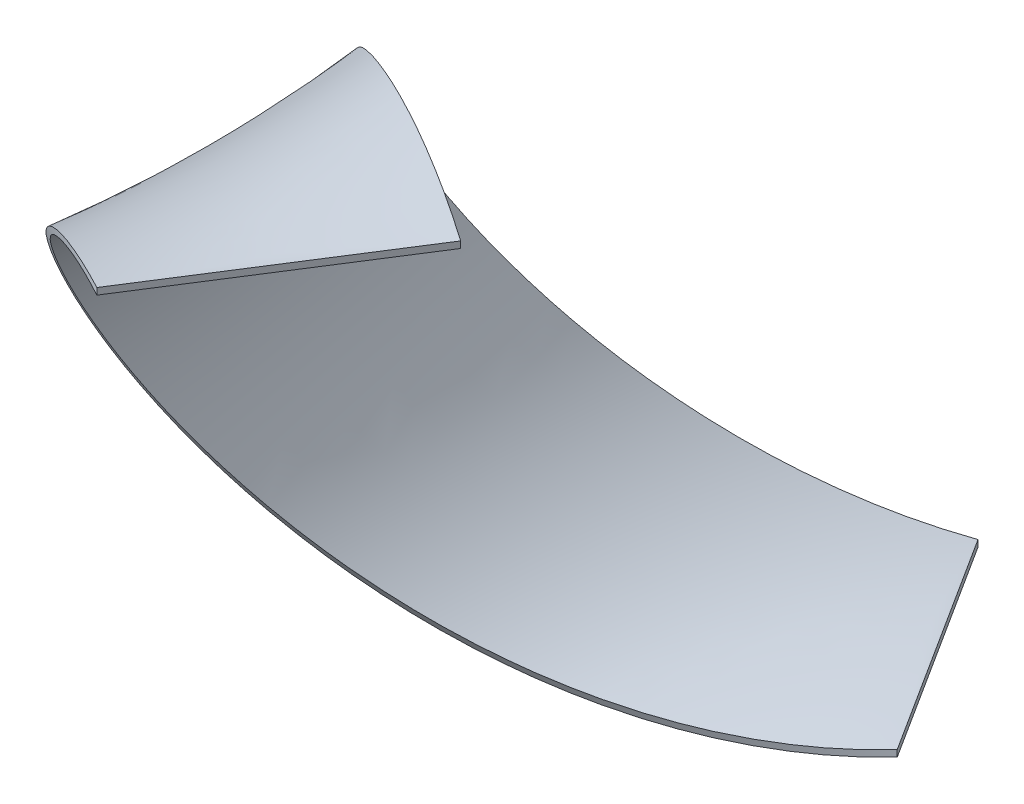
ISO-10303-21;
HEADER;
FILE_DESCRIPTION(('STEP AP214'),'2;1');
FILE_NAME('part.step','',(''),(''),'','','');
FILE_SCHEMA(('AUTOMOTIVE_DESIGN { 1 0 10303 214 1 1 1 1 }'));
ENDSEC;
DATA;
#1=APPLICATION_CONTEXT('core data for automotive mechanical design processes');
#2=APPLICATION_PROTOCOL_DEFINITION('international standard','automotive_design',2000,#1);
#3=PRODUCT_CONTEXT('',#1,'mechanical');
#4=PRODUCT('Part','Part','',(#3));
#5=PRODUCT_RELATED_PRODUCT_CATEGORY('part','',(#4));
#6=PRODUCT_DEFINITION_FORMATION('','',#4);
#7=PRODUCT_DEFINITION_CONTEXT('part definition',#1,'design');
#8=PRODUCT_DEFINITION('design','',#6,#7);
#9=PRODUCT_DEFINITION_SHAPE('','',#8);
#10=(LENGTH_UNIT() NAMED_UNIT(*) SI_UNIT(.MILLI.,.METRE.));
#11=(NAMED_UNIT(*) PLANE_ANGLE_UNIT() SI_UNIT($,.RADIAN.));
#12=(NAMED_UNIT(*) SI_UNIT($,.STERADIAN.) SOLID_ANGLE_UNIT());
#13=UNCERTAINTY_MEASURE_WITH_UNIT(LENGTH_MEASURE(1.E-05),#10,'distance_accuracy_value','');
#14=(GEOMETRIC_REPRESENTATION_CONTEXT(3) GLOBAL_UNCERTAINTY_ASSIGNED_CONTEXT((#13)) GLOBAL_UNIT_ASSIGNED_CONTEXT((#10,
#11,#12)) REPRESENTATION_CONTEXT('',''));
#15=CARTESIAN_POINT('',(0.,0.,0.));
#16=DIRECTION('',(0.,0.,1.));
#17=DIRECTION('',(1.,0.,0.));
#18=AXIS2_PLACEMENT_3D('',#15,#16,#17);
#19=CARTESIAN_POINT('',(5.37029272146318,-25.,8.43563608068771));
#20=DIRECTION('',(0.843563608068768,0.,-0.537029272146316));
#21=DIRECTION('',(-0.537029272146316,0.,-0.843563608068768));
#22=AXIS2_PLACEMENT_3D('',#19,#20,#21);
#23=PLANE('',#22);
#24=DIRECTION('',(0.,-1.,0.));
#25=VECTOR('',#24,1.);
#26=CARTESIAN_POINT('',(5.37029272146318,-24.75,8.43563608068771));
#27=LINE('',#26,#25);
#28=CARTESIAN_POINT('',(5.37029272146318,-24.75,8.43563608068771));
#29=VERTEX_POINT('',#28);
#30=CARTESIAN_POINT('',(5.37029272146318,-25.25,8.4356360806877));
#31=VERTEX_POINT('',#30);
#32=EDGE_CURVE('E49',#29,#31,#27,.T.);
#33=ORIENTED_EDGE('',*,*,#32,.T.);
#34=DIRECTION('',(-0.537029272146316,0.,-0.843563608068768));
#35=VECTOR('',#34,1.);
#36=CARTESIAN_POINT('',(-5.37029272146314,-25.25,-8.43563608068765));
#37=LINE('',#36,#35);
#38=CARTESIAN_POINT('',(-5.37029272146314,-25.25,-8.43563608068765));
#39=VERTEX_POINT('',#38);
#40=EDGE_CURVE('E57',#31,#39,#37,.T.);
#41=ORIENTED_EDGE('',*,*,#40,.T.);
#42=DIRECTION('',(0.,1.,0.));
#43=VECTOR('',#42,1.);
#44=CARTESIAN_POINT('',(-5.37029272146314,-24.75,-8.43563608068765));
#45=LINE('',#44,#43);
#46=CARTESIAN_POINT('',(-5.37029272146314,-24.75,-8.43563608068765));
#47=VERTEX_POINT('',#46);
#48=EDGE_CURVE('E88',#39,#47,#45,.T.);
#49=ORIENTED_EDGE('',*,*,#48,.T.);
#50=DIRECTION('',(0.537029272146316,0.,0.843563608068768));
#51=VECTOR('',#50,1.);
#52=CARTESIAN_POINT('',(-5.37029272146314,-24.75,-8.43563608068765));
#53=LINE('',#52,#51);
#54=EDGE_CURVE('E85',#47,#29,#53,.T.);
#55=ORIENTED_EDGE('',*,*,#54,.T.);
#56=EDGE_LOOP('',(#33,#41,#49,#55));
#57=FACE_BOUND('',#56,.T.);
#58=ADVANCED_FACE('F40',(#57),#23,.T.);
#59=CARTESIAN_POINT('',(-5.37029272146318,25.,58.4356360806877));
#60=DIRECTION('',(0.843563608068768,0.,0.537029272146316));
#61=DIRECTION('',(0.537029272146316,0.,-0.843563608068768));
#62=AXIS2_PLACEMENT_3D('',#59,#60,#61);
#63=PLANE('',#62);
#64=DIRECTION('',(0.,1.,0.));
#65=VECTOR('',#64,1.);
#66=CARTESIAN_POINT('',(-5.37029272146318,25.,58.4356360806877));
#67=LINE('',#66,#65);
#68=CARTESIAN_POINT('',(-5.37029272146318,24.75,58.4356360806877));
#69=VERTEX_POINT('',#68);
#70=CARTESIAN_POINT('',(-5.37029272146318,25.25,58.4356360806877));
#71=VERTEX_POINT('',#70);
#72=EDGE_CURVE('E12',#69,#71,#67,.T.);
#73=ORIENTED_EDGE('',*,*,#72,.F.);
#74=DIRECTION('',(-0.537029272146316,0.,0.843563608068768));
#75=VECTOR('',#74,1.);
#76=CARTESIAN_POINT('',(5.37029272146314,24.75,41.5643639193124));
#77=LINE('',#76,#75);
#78=CARTESIAN_POINT('',(5.37029272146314,24.75,41.5643639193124));
#79=VERTEX_POINT('',#78);
#80=EDGE_CURVE('E92',#79,#69,#77,.T.);
#81=ORIENTED_EDGE('',*,*,#80,.F.);
#82=DIRECTION('',(0.,-1.,0.));
#83=VECTOR('',#82,1.);
#84=CARTESIAN_POINT('',(5.37029272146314,25.,41.5643639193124));
#85=LINE('',#84,#83);
#86=CARTESIAN_POINT('',(5.37029272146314,25.25,41.5643639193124));
#87=VERTEX_POINT('',#86);
#88=EDGE_CURVE('E113',#87,#79,#85,.T.);
#89=ORIENTED_EDGE('',*,*,#88,.F.);
#90=DIRECTION('',(0.537029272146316,0.,-0.843563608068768));
#91=VECTOR('',#90,1.);
#92=CARTESIAN_POINT('',(0.,25.25,50.));
#93=LINE('',#92,#91);
#94=EDGE_CURVE('E65',#71,#87,#93,.T.);
#95=ORIENTED_EDGE('',*,*,#94,.F.);
#96=EDGE_LOOP('',(#73,#81,#89,#95));
#97=FACE_BOUND('',#96,.T.);
#98=ADVANCED_FACE('F42',(#97),#63,.T.);
#99=CARTESIAN_POINT('',(5.37029272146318,-24.75,8.43563608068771));
#100=CARTESIAN_POINT('',(3.07686747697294,-25.2476309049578,9.90622431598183));
#101=CARTESIAN_POINT('',(0.731052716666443,-25.3153729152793,11.3768125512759));
#102=CARTESIAN_POINT('',(-1.61476204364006,-25.3831149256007,12.8474007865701));
#103=CARTESIAN_POINT('',(-3.93308241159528,-25.0186611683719,14.3179890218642));
#104=CARTESIAN_POINT('',(-6.2514027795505,-24.6542074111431,15.7885772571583));
#105=CARTESIAN_POINT('',(-8.46328113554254,-23.8699689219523,17.2591654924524));
#106=CARTESIAN_POINT('',(-10.6751594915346,-23.0857304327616,18.7297537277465));
#107=CARTESIAN_POINT('',(-12.7052729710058,-21.9084135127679,20.2003419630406));
#108=CARTESIAN_POINT('',(-14.735386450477,-20.7310965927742,21.6709301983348));
#109=CARTESIAN_POINT('',(-16.5146019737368,-19.2007933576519,23.1415184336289));
#110=CARTESIAN_POINT('',(-18.2938174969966,-17.6704901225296,24.612106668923));
#111=CARTESIAN_POINT('',(-19.7615460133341,-15.8393132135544,26.0826949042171));
#112=CARTESIAN_POINT('',(-21.2292745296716,-14.0081363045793,27.5532831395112));
#113=CARTESIAN_POINT('',(-22.3355343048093,-11.9384442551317,29.0238713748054));
#114=CARTESIAN_POINT('',(-23.441794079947,-9.86875220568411,30.4944596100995));
#115=CARTESIAN_POINT('',(-24.148912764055,-7.63102589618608,31.9650478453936));
#116=CARTESIAN_POINT('',(-24.8560314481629,-5.39329958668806,33.4356360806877));
#117=CARTESIAN_POINT('',(-25.1399289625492,-3.06374210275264,34.9062243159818));
#118=CARTESIAN_POINT('',(-25.4238264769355,-0.734184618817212,36.3768125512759));
#119=CARTESIAN_POINT('',(-25.2748350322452,1.60787375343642,37.8474007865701));
#120=CARTESIAN_POINT('',(-25.125843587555,3.94993212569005,39.3179890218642));
#121=CARTESIAN_POINT('',(-24.5490369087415,6.22473539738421,40.7885772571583));
#122=CARTESIAN_POINT('',(-23.9722302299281,8.49953866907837,42.2591654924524));
#123=CARTESIAN_POINT('',(-22.9872507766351,10.6296211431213,43.7297537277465));
#124=CARTESIAN_POINT('',(-22.0022713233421,12.7597036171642,45.2003419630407));
#125=CARTESIAN_POINT('',(-20.6426613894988,14.6725278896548,46.6709301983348));
#126=CARTESIAN_POINT('',(-19.2830514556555,16.5853521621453,48.1415184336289));
#127=CARTESIAN_POINT('',(-17.5951109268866,18.2157792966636,49.612106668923));
#128=CARTESIAN_POINT('',(-15.9071703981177,19.8462064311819,51.0826949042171));
#129=CARTESIAN_POINT('',(-13.9483800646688,21.1387141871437,52.5532831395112));
#130=CARTESIAN_POINT('',(-11.9895897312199,22.4312219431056,54.0238713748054));
#131=CARTESIAN_POINT('',(-9.82665384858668,23.3417955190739,55.4944596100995));
#132=CARTESIAN_POINT('',(-7.66371796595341,24.2523690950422,56.9650478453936));
#133=CARTESIAN_POINT('',(-5.37029272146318,24.75,58.4356360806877));
#134=CARTESIAN_POINT('',(5.37029272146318,-25.25,8.4356360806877));
#135=CARTESIAN_POINT('',(3.03053565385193,-25.7476309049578,9.90622431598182));
#136=CARTESIAN_POINT('',(0.639177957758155,-25.8068594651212,11.3768125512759));
#137=CARTESIAN_POINT('',(-1.75217973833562,-25.8660880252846,12.8474007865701));
#138=CARTESIAN_POINT('',(-4.11370324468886,-25.4848972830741,14.3179890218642));
#139=CARTESIAN_POINT('',(-6.4752267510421,-25.1037065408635,15.7885772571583));
#140=CARTESIAN_POINT('',(-8.72649721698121,-24.2950774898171,17.2591654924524));
#141=CARTESIAN_POINT('',(-10.9777676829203,-23.4864484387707,18.7297537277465));
#142=CARTESIAN_POINT('',(-13.0421207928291,-22.2779179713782,20.2003419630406));
#143=CARTESIAN_POINT('',(-15.1064739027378,-21.0693875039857,21.6709301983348));
#144=CARTESIAN_POINT('',(-16.9136105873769,-19.5021106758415,23.1415184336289));
#145=CARTESIAN_POINT('',(-18.720747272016,-17.9348338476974,24.612106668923));
#146=CARTESIAN_POINT('',(-20.2091276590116,-16.0621823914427,26.0826949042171));
#147=CARTESIAN_POINT('',(-21.6975080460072,-14.189530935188,27.5532831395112));
#148=CARTESIAN_POINT('',(-22.8164471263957,-12.0752757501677,29.0238713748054));
#149=CARTESIAN_POINT('',(-23.9353862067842,-9.96102056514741,30.4944596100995));
#150=CARTESIAN_POINT('',(-24.6467798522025,-7.67716007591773,31.9650478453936));
#151=CARTESIAN_POINT('',(-25.3581734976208,-5.39329958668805,33.4356360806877));
#152=CARTESIAN_POINT('',(-25.6377960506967,-3.01760792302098,34.9062243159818));
#153=CARTESIAN_POINT('',(-25.9174186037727,-0.641916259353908,36.3768125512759));
#154=CARTESIAN_POINT('',(-25.7557478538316,1.74470524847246,37.8474007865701));
#155=CARTESIAN_POINT('',(-25.5940771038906,4.13132675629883,39.3179890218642));
#156=CARTESIAN_POINT('',(-24.996618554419,6.44760457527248,40.7885772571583));
#157=CARTESIAN_POINT('',(-24.3991600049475,8.76388239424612,42.2591654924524));
#158=CARTESIAN_POINT('',(-23.3862593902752,10.9309384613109,43.7297537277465));
#159=CARTESIAN_POINT('',(-22.3733587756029,13.0979945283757,45.2003419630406));
#160=CARTESIAN_POINT('',(-20.9795092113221,15.0420323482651,46.6709301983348));
#161=CARTESIAN_POINT('',(-19.5856596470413,16.9860701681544,48.1415184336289));
#162=CARTESIAN_POINT('',(-17.8583270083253,18.6408878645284,49.612106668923));
#163=CARTESIAN_POINT('',(-16.1309943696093,20.2957055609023,51.0826949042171));
#164=CARTESIAN_POINT('',(-14.1290008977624,21.6049503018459,52.5532831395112));
#165=CARTESIAN_POINT('',(-12.1270074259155,22.9141950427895,54.0238713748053));
#166=CARTESIAN_POINT('',(-9.91852860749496,23.8332820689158,55.4944596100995));
#167=CARTESIAN_POINT('',(-7.71004978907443,24.7523690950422,56.9650478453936));
#168=CARTESIAN_POINT('',(-5.37029272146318,25.25,58.4356360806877));
#169=(BOUNDED_SURFACE() B_SPLINE_SURFACE(1,2,((#99,#100,#101,#102,#103,#104,#105,#106,#107,#108,
#109,#110,#111,#112,#113,#114,#115,#116,#117,#118,#119,#120,#121,#122,#123,#124,#125,#126,#127,
#128,#129,#130,#131,#132,#133),(#134,#135,#136,#137,#138,#139,#140,#141,#142,#143,#144,#145,
#146,#147,#148,#149,#150,#151,#152,#153,#154,#155,#156,#157,#158,#159,#160,#161,#162,#163,#164,
#165,#166,#167,#168)),.UNSPECIFIED.,.F.,.F.,.F.) B_SPLINE_SURFACE_WITH_KNOTS((2,2),(3,2,2,2,2,2,
2,2,2,2,2,2,2,2,2,2,2,3),(0.,0.0121951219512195),(0.,0.0294117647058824,0.0588235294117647,
0.0882352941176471,0.117647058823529,0.147058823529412,0.176470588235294,0.205882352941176,
0.235294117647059,0.264705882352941,0.294117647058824,0.323529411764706,0.352941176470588,
0.382352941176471,0.411764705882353,0.441176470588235,0.470588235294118,0.5),
.UNSPECIFIED.) GEOMETRIC_REPRESENTATION_ITEM() RATIONAL_B_SPLINE_SURFACE(((1.,0.995734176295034,
1.,0.995734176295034,1.,0.995734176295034,1.,0.995734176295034,1.,0.995734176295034,1.,
0.995734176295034,1.,0.995734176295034,1.,0.995734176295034,1.,0.995734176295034,1.,
0.995734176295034,1.,0.995734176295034,1.,0.995734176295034,1.,0.995734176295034,1.,
0.995734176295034,1.,0.995734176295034,1.,0.995734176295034,1.,0.995734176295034,1.),(1.,
0.995734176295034,1.,0.995734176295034,1.,0.995734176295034,1.,0.995734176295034,1.,
0.995734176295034,1.,0.995734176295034,1.,0.995734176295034,1.,0.995734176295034,1.,
0.995734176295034,1.,0.995734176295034,1.,0.995734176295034,1.,0.995734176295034,1.,
0.995734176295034,1.,0.995734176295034,1.,0.995734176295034,1.,0.995734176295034,1.,
0.995734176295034,1.))) REPRESENTATION_ITEM('') SURFACE());
#170=CARTESIAN_POINT('',(5.37029272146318,-24.75,8.43563608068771));
#171=CARTESIAN_POINT('',(3.07686747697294,-25.2476309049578,9.90622431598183));
#172=CARTESIAN_POINT('',(0.731052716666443,-25.3153729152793,11.3768125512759));
#173=CARTESIAN_POINT('',(-1.61476204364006,-25.3831149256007,12.8474007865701));
#174=CARTESIAN_POINT('',(-3.93308241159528,-25.0186611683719,14.3179890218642));
#175=CARTESIAN_POINT('',(-6.2514027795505,-24.6542074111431,15.7885772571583));
#176=CARTESIAN_POINT('',(-8.46328113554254,-23.8699689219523,17.2591654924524));
#177=CARTESIAN_POINT('',(-10.6751594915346,-23.0857304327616,18.7297537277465));
#178=CARTESIAN_POINT('',(-12.7052729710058,-21.9084135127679,20.2003419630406));
#179=CARTESIAN_POINT('',(-14.735386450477,-20.7310965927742,21.6709301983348));
#180=CARTESIAN_POINT('',(-16.5146019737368,-19.2007933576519,23.1415184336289));
#181=CARTESIAN_POINT('',(-18.2938174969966,-17.6704901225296,24.612106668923));
#182=CARTESIAN_POINT('',(-19.7615460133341,-15.8393132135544,26.0826949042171));
#183=CARTESIAN_POINT('',(-21.2292745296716,-14.0081363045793,27.5532831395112));
#184=CARTESIAN_POINT('',(-22.3355343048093,-11.9384442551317,29.0238713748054));
#185=CARTESIAN_POINT('',(-23.441794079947,-9.86875220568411,30.4944596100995));
#186=CARTESIAN_POINT('',(-24.148912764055,-7.63102589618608,31.9650478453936));
#187=CARTESIAN_POINT('',(-24.8560314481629,-5.39329958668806,33.4356360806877));
#188=CARTESIAN_POINT('',(-25.1399289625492,-3.06374210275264,34.9062243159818));
#189=CARTESIAN_POINT('',(-25.4238264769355,-0.734184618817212,36.3768125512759));
#190=CARTESIAN_POINT('',(-25.2748350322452,1.60787375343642,37.8474007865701));
#191=CARTESIAN_POINT('',(-25.125843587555,3.94993212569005,39.3179890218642));
#192=CARTESIAN_POINT('',(-24.5490369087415,6.22473539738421,40.7885772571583));
#193=CARTESIAN_POINT('',(-23.9722302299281,8.49953866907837,42.2591654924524));
#194=CARTESIAN_POINT('',(-22.9872507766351,10.6296211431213,43.7297537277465));
#195=CARTESIAN_POINT('',(-22.0022713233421,12.7597036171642,45.2003419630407));
#196=CARTESIAN_POINT('',(-20.6426613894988,14.6725278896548,46.6709301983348));
#197=CARTESIAN_POINT('',(-19.2830514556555,16.5853521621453,48.1415184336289));
#198=CARTESIAN_POINT('',(-17.5951109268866,18.2157792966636,49.612106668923));
#199=CARTESIAN_POINT('',(-15.9071703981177,19.8462064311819,51.0826949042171));
#200=CARTESIAN_POINT('',(-13.9483800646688,21.1387141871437,52.5532831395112));
#201=CARTESIAN_POINT('',(-11.9895897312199,22.4312219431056,54.0238713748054));
#202=CARTESIAN_POINT('',(-9.82665384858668,23.3417955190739,55.4944596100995));
#203=CARTESIAN_POINT('',(-7.66371796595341,24.2523690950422,56.9650478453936));
#204=CARTESIAN_POINT('',(-5.37029272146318,24.75,58.4356360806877));
#205=(BOUNDED_CURVE() B_SPLINE_CURVE(2,(#170,#171,#172,#173,#174,#175,#176,#177,#178,#179,#180,
#181,#182,#183,#184,#185,#186,#187,#188,#189,#190,#191,#192,#193,#194,#195,#196,#197,#198,#199,
#200,#201,#202,#203,#204),.UNSPECIFIED.,.F.,.F.) B_SPLINE_CURVE_WITH_KNOTS((3,2,2,2,2,2,2,2,2,2,
2,2,2,2,2,2,2,3),(0.,0.0294117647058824,0.0588235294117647,0.0882352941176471,0.117647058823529,
0.147058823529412,0.176470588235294,0.205882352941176,0.235294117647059,0.264705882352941,
0.294117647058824,0.323529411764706,0.352941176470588,0.382352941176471,0.411764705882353,
0.441176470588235,0.470588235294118,0.5),
.UNSPECIFIED.) CURVE() GEOMETRIC_REPRESENTATION_ITEM() RATIONAL_B_SPLINE_CURVE((1.,
0.995734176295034,1.,0.995734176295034,1.,0.995734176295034,1.,0.995734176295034,1.,
0.995734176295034,1.,0.995734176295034,1.,0.995734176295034,1.,0.995734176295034,1.,
0.995734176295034,1.,0.995734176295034,1.,0.995734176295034,1.,0.995734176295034,1.,
0.995734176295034,1.,0.995734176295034,1.,0.995734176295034,1.,0.995734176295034,1.,
0.995734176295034,1.)) REPRESENTATION_ITEM(''));
#206=EDGE_CURVE('E94',#29,#69,#205,.T.);
#207=CARTESIAN_POINT('',(5.37029272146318,-25.25,8.4356360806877));
#208=CARTESIAN_POINT('',(3.03053565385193,-25.7476309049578,9.90622431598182));
#209=CARTESIAN_POINT('',(0.639177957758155,-25.8068594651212,11.3768125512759));
#210=CARTESIAN_POINT('',(-1.75217973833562,-25.8660880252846,12.8474007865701));
#211=CARTESIAN_POINT('',(-4.11370324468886,-25.4848972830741,14.3179890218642));
#212=CARTESIAN_POINT('',(-6.4752267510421,-25.1037065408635,15.7885772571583));
#213=CARTESIAN_POINT('',(-8.72649721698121,-24.2950774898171,17.2591654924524));
#214=CARTESIAN_POINT('',(-10.9777676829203,-23.4864484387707,18.7297537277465));
#215=CARTESIAN_POINT('',(-13.0421207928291,-22.2779179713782,20.2003419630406));
#216=CARTESIAN_POINT('',(-15.1064739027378,-21.0693875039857,21.6709301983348));
#217=CARTESIAN_POINT('',(-16.9136105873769,-19.5021106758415,23.1415184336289));
#218=CARTESIAN_POINT('',(-18.720747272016,-17.9348338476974,24.612106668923));
#219=CARTESIAN_POINT('',(-20.2091276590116,-16.0621823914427,26.0826949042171));
#220=CARTESIAN_POINT('',(-21.6975080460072,-14.189530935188,27.5532831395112));
#221=CARTESIAN_POINT('',(-22.8164471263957,-12.0752757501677,29.0238713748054));
#222=CARTESIAN_POINT('',(-23.9353862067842,-9.96102056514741,30.4944596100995));
#223=CARTESIAN_POINT('',(-24.6467798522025,-7.67716007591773,31.9650478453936));
#224=CARTESIAN_POINT('',(-25.3581734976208,-5.39329958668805,33.4356360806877));
#225=CARTESIAN_POINT('',(-25.6377960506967,-3.01760792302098,34.9062243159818));
#226=CARTESIAN_POINT('',(-25.9174186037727,-0.641916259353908,36.3768125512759));
#227=CARTESIAN_POINT('',(-25.7557478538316,1.74470524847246,37.8474007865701));
#228=CARTESIAN_POINT('',(-25.5940771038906,4.13132675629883,39.3179890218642));
#229=CARTESIAN_POINT('',(-24.996618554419,6.44760457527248,40.7885772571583));
#230=CARTESIAN_POINT('',(-24.3991600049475,8.76388239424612,42.2591654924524));
#231=CARTESIAN_POINT('',(-23.3862593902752,10.9309384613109,43.7297537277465));
#232=CARTESIAN_POINT('',(-22.3733587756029,13.0979945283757,45.2003419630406));
#233=CARTESIAN_POINT('',(-20.9795092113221,15.0420323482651,46.6709301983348));
#234=CARTESIAN_POINT('',(-19.5856596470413,16.9860701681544,48.1415184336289));
#235=CARTESIAN_POINT('',(-17.8583270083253,18.6408878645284,49.612106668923));
#236=CARTESIAN_POINT('',(-16.1309943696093,20.2957055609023,51.0826949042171));
#237=CARTESIAN_POINT('',(-14.1290008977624,21.6049503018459,52.5532831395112));
#238=CARTESIAN_POINT('',(-12.1270074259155,22.9141950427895,54.0238713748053));
#239=CARTESIAN_POINT('',(-9.91852860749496,23.8332820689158,55.4944596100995));
#240=CARTESIAN_POINT('',(-7.71004978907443,24.7523690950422,56.9650478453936));
#241=CARTESIAN_POINT('',(-5.37029272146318,25.25,58.4356360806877));
#242=(BOUNDED_CURVE() B_SPLINE_CURVE(2,(#207,#208,#209,#210,#211,#212,#213,#214,#215,#216,#217,
#218,#219,#220,#221,#222,#223,#224,#225,#226,#227,#228,#229,#230,#231,#232,#233,#234,#235,#236,
#237,#238,#239,#240,#241),.UNSPECIFIED.,.F.,.F.) B_SPLINE_CURVE_WITH_KNOTS((3,2,2,2,2,2,2,2,2,2,
2,2,2,2,2,2,2,3),(0.,0.0294117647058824,0.0588235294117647,0.0882352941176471,0.117647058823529,
0.147058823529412,0.176470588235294,0.205882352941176,0.235294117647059,0.264705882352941,
0.294117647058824,0.323529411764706,0.352941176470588,0.382352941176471,0.411764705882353,
0.441176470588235,0.470588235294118,0.5),
.UNSPECIFIED.) CURVE() GEOMETRIC_REPRESENTATION_ITEM() RATIONAL_B_SPLINE_CURVE((1.,
0.995734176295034,1.,0.995734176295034,1.,0.995734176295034,1.,0.995734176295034,1.,
0.995734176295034,1.,0.995734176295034,1.,0.995734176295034,1.,0.995734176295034,1.,
0.995734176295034,1.,0.995734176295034,1.,0.995734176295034,1.,0.995734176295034,1.,
0.995734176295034,1.,0.995734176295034,1.,0.995734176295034,1.,0.995734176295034,1.,
0.995734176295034,1.)) REPRESENTATION_ITEM(''));
#243=EDGE_CURVE('E100',#31,#71,#242,.T.);
#244=ORIENTED_EDGE('',*,*,#32,.F.);
#245=ORIENTED_EDGE('',*,*,#206,.T.);
#246=ORIENTED_EDGE('',*,*,#72,.T.);
#247=ORIENTED_EDGE('',*,*,#243,.F.);
#248=EDGE_LOOP('',(#244,#245,#246,#247));
#249=FACE_BOUND('',#248,.T.);
#250=ADVANCED_FACE('F99',(#249),#169,.F.);
#251=CARTESIAN_POINT('',(5.37029272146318,-25.25,8.4356360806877));
#252=CARTESIAN_POINT('',(3.03053565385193,-25.7476309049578,9.90622431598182));
#253=CARTESIAN_POINT('',(0.639177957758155,-25.8068594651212,11.3768125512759));
#254=CARTESIAN_POINT('',(-1.75217973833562,-25.8660880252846,12.8474007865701));
#255=CARTESIAN_POINT('',(-4.11370324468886,-25.4848972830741,14.3179890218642));
#256=CARTESIAN_POINT('',(-6.4752267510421,-25.1037065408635,15.7885772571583));
#257=CARTESIAN_POINT('',(-8.72649721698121,-24.2950774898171,17.2591654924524));
#258=CARTESIAN_POINT('',(-10.9777676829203,-23.4864484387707,18.7297537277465));
#259=CARTESIAN_POINT('',(-13.0421207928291,-22.2779179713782,20.2003419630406));
#260=CARTESIAN_POINT('',(-15.1064739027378,-21.0693875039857,21.6709301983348));
#261=CARTESIAN_POINT('',(-16.9136105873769,-19.5021106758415,23.1415184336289));
#262=CARTESIAN_POINT('',(-18.720747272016,-17.9348338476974,24.612106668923));
#263=CARTESIAN_POINT('',(-20.2091276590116,-16.0621823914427,26.0826949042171));
#264=CARTESIAN_POINT('',(-21.6975080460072,-14.189530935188,27.5532831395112));
#265=CARTESIAN_POINT('',(-22.8164471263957,-12.0752757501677,29.0238713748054));
#266=CARTESIAN_POINT('',(-23.9353862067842,-9.96102056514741,30.4944596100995));
#267=CARTESIAN_POINT('',(-24.6467798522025,-7.67716007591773,31.9650478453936));
#268=CARTESIAN_POINT('',(-25.3581734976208,-5.39329958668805,33.4356360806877));
#269=CARTESIAN_POINT('',(-25.6377960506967,-3.01760792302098,34.9062243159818));
#270=CARTESIAN_POINT('',(-25.9174186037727,-0.641916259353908,36.3768125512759));
#271=CARTESIAN_POINT('',(-25.7557478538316,1.74470524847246,37.8474007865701));
#272=CARTESIAN_POINT('',(-25.5940771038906,4.13132675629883,39.3179890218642));
#273=CARTESIAN_POINT('',(-24.996618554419,6.44760457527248,40.7885772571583));
#274=CARTESIAN_POINT('',(-24.3991600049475,8.76388239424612,42.2591654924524));
#275=CARTESIAN_POINT('',(-23.3862593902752,10.9309384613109,43.7297537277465));
#276=CARTESIAN_POINT('',(-22.3733587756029,13.0979945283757,45.2003419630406));
#277=CARTESIAN_POINT('',(-20.9795092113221,15.0420323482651,46.6709301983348));
#278=CARTESIAN_POINT('',(-19.5856596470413,16.9860701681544,48.1415184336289));
#279=CARTESIAN_POINT('',(-17.8583270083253,18.6408878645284,49.612106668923));
#280=CARTESIAN_POINT('',(-16.1309943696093,20.2957055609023,51.0826949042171));
#281=CARTESIAN_POINT('',(-14.1290008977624,21.6049503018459,52.5532831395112));
#282=CARTESIAN_POINT('',(-12.1270074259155,22.9141950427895,54.0238713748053));
#283=CARTESIAN_POINT('',(-9.91852860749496,23.8332820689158,55.4944596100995));
#284=CARTESIAN_POINT('',(-7.71004978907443,24.7523690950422,56.9650478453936));
#285=CARTESIAN_POINT('',(-5.37029272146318,25.25,58.4356360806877));
#286=CARTESIAN_POINT('',(-5.37029272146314,-25.25,-8.43563608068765));
#287=CARTESIAN_POINT('',(-7.71004978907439,-24.7523690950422,-6.96504784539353));
#288=CARTESIAN_POINT('',(-9.91852860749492,-23.8332820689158,-5.49445961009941));
#289=CARTESIAN_POINT('',(-12.1270074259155,-22.9141950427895,-4.0238713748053));
#290=CARTESIAN_POINT('',(-14.1290008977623,-21.6049503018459,-2.55328313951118));
#291=CARTESIAN_POINT('',(-16.1309943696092,-20.2957055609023,-1.08269490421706));
#292=CARTESIAN_POINT('',(-17.8583270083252,-18.6408878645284,0.387893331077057));
#293=CARTESIAN_POINT('',(-19.5856596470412,-16.9860701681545,1.85848156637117));
#294=CARTESIAN_POINT('',(-20.979509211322,-15.0420323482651,3.32906980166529));
#295=CARTESIAN_POINT('',(-22.3733587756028,-13.0979945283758,4.79965803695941));
#296=CARTESIAN_POINT('',(-23.3862593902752,-10.930938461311,6.27024627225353));
#297=CARTESIAN_POINT('',(-24.3991600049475,-8.76388239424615,7.74083450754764));
#298=CARTESIAN_POINT('',(-24.996618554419,-6.44760457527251,9.21142274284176));
#299=CARTESIAN_POINT('',(-25.5940771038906,-4.13132675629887,10.6820109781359));
#300=CARTESIAN_POINT('',(-25.7557478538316,-1.74470524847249,12.15259921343));
#301=CARTESIAN_POINT('',(-25.9174186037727,0.641916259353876,13.6231874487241));
#302=CARTESIAN_POINT('',(-25.6377960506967,3.01760792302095,15.0937756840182));
#303=CARTESIAN_POINT('',(-25.3581734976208,5.39329958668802,16.5643639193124));
#304=CARTESIAN_POINT('',(-24.6467798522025,7.6771600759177,18.0349521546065));
#305=CARTESIAN_POINT('',(-23.9353862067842,9.96102056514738,19.5055403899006));
#306=CARTESIAN_POINT('',(-22.8164471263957,12.0752757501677,20.9761286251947));
#307=CARTESIAN_POINT('',(-21.6975080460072,14.189530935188,22.4467168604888));
#308=CARTESIAN_POINT('',(-20.2091276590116,16.0621823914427,23.9173050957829));
#309=CARTESIAN_POINT('',(-18.720747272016,17.9348338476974,25.3878933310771));
#310=CARTESIAN_POINT('',(-16.9136105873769,19.5021106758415,26.8584815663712));
#311=CARTESIAN_POINT('',(-15.1064739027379,21.0693875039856,28.3290698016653));
#312=CARTESIAN_POINT('',(-13.0421207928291,22.2779179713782,29.7996580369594));
#313=CARTESIAN_POINT('',(-10.9777676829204,23.4864484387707,31.2702462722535));
#314=CARTESIAN_POINT('',(-8.72649721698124,24.2950774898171,32.7408345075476));
#315=CARTESIAN_POINT('',(-6.47522675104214,25.1037065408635,34.2114227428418));
#316=CARTESIAN_POINT('',(-4.11370324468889,25.4848972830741,35.6820109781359));
#317=CARTESIAN_POINT('',(-1.75217973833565,25.8660880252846,37.15259921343));
#318=CARTESIAN_POINT('',(0.63917795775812,25.8068594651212,38.6231874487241));
#319=CARTESIAN_POINT('',(3.03053565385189,25.7476309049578,40.0937756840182));
#320=CARTESIAN_POINT('',(5.37029272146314,25.25,41.5643639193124));
#321=(BOUNDED_SURFACE() B_SPLINE_SURFACE(1,2,((#251,#252,#253,#254,#255,#256,#257,#258,#259,
#260,#261,#262,#263,#264,#265,#266,#267,#268,#269,#270,#271,#272,#273,#274,#275,#276,#277,#278,
#279,#280,#281,#282,#283,#284,#285),(#286,#287,#288,#289,#290,#291,#292,#293,#294,#295,#296,
#297,#298,#299,#300,#301,#302,#303,#304,#305,#306,#307,#308,#309,#310,#311,#312,#313,#314,#315,
#316,#317,#318,#319,#320)),.UNSPECIFIED.,.F.,.F.,.F.) B_SPLINE_SURFACE_WITH_KNOTS((2,2),(3,2,2,
2,2,2,2,2,2,2,2,2,2,2,2,2,2,3),(0.0121951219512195,0.5),(0.,0.0294117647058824,
0.0588235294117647,0.0882352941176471,0.117647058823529,0.147058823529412,0.176470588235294,
0.205882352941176,0.235294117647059,0.264705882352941,0.294117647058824,0.323529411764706,
0.352941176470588,0.382352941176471,0.411764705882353,0.441176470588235,0.470588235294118,0.5),
.UNSPECIFIED.) GEOMETRIC_REPRESENTATION_ITEM() RATIONAL_B_SPLINE_SURFACE(((1.,0.995734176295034,
1.,0.995734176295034,1.,0.995734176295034,1.,0.995734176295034,1.,0.995734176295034,1.,
0.995734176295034,1.,0.995734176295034,1.,0.995734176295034,1.,0.995734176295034,1.,
0.995734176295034,1.,0.995734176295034,1.,0.995734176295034,1.,0.995734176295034,1.,
0.995734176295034,1.,0.995734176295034,1.,0.995734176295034,1.,0.995734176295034,1.),(1.,
0.995734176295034,1.,0.995734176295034,1.,0.995734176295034,1.,0.995734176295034,1.,
0.995734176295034,1.,0.995734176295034,1.,0.995734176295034,1.,0.995734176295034,1.,
0.995734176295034,1.,0.995734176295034,1.,0.995734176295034,1.,0.995734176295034,1.,
0.995734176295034,1.,0.995734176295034,1.,0.995734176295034,1.,0.995734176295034,1.,
0.995734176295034,1.))) REPRESENTATION_ITEM('') SURFACE());
#322=CARTESIAN_POINT('',(-5.37029272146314,-25.25,-8.43563608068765));
#323=CARTESIAN_POINT('',(-7.71004978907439,-24.7523690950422,-6.96504784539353));
#324=CARTESIAN_POINT('',(-9.91852860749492,-23.8332820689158,-5.49445961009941));
#325=CARTESIAN_POINT('',(-12.1270074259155,-22.9141950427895,-4.0238713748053));
#326=CARTESIAN_POINT('',(-14.1290008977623,-21.6049503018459,-2.55328313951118));
#327=CARTESIAN_POINT('',(-16.1309943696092,-20.2957055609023,-1.08269490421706));
#328=CARTESIAN_POINT('',(-17.8583270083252,-18.6408878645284,0.387893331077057));
#329=CARTESIAN_POINT('',(-19.5856596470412,-16.9860701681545,1.85848156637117));
#330=CARTESIAN_POINT('',(-20.979509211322,-15.0420323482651,3.32906980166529));
#331=CARTESIAN_POINT('',(-22.3733587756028,-13.0979945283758,4.79965803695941));
#332=CARTESIAN_POINT('',(-23.3862593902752,-10.930938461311,6.27024627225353));
#333=CARTESIAN_POINT('',(-24.3991600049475,-8.76388239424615,7.74083450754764));
#334=CARTESIAN_POINT('',(-24.996618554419,-6.44760457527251,9.21142274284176));
#335=CARTESIAN_POINT('',(-25.5940771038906,-4.13132675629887,10.6820109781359));
#336=CARTESIAN_POINT('',(-25.7557478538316,-1.74470524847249,12.15259921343));
#337=CARTESIAN_POINT('',(-25.9174186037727,0.641916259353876,13.6231874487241));
#338=CARTESIAN_POINT('',(-25.6377960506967,3.01760792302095,15.0937756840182));
#339=CARTESIAN_POINT('',(-25.3581734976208,5.39329958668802,16.5643639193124));
#340=CARTESIAN_POINT('',(-24.6467798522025,7.6771600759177,18.0349521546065));
#341=CARTESIAN_POINT('',(-23.9353862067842,9.96102056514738,19.5055403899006));
#342=CARTESIAN_POINT('',(-22.8164471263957,12.0752757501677,20.9761286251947));
#343=CARTESIAN_POINT('',(-21.6975080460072,14.189530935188,22.4467168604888));
#344=CARTESIAN_POINT('',(-20.2091276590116,16.0621823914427,23.9173050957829));
#345=CARTESIAN_POINT('',(-18.720747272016,17.9348338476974,25.3878933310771));
#346=CARTESIAN_POINT('',(-16.9136105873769,19.5021106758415,26.8584815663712));
#347=CARTESIAN_POINT('',(-15.1064739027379,21.0693875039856,28.3290698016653));
#348=CARTESIAN_POINT('',(-13.0421207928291,22.2779179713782,29.7996580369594));
#349=CARTESIAN_POINT('',(-10.9777676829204,23.4864484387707,31.2702462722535));
#350=CARTESIAN_POINT('',(-8.72649721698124,24.2950774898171,32.7408345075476));
#351=CARTESIAN_POINT('',(-6.47522675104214,25.1037065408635,34.2114227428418));
#352=CARTESIAN_POINT('',(-4.11370324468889,25.4848972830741,35.6820109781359));
#353=CARTESIAN_POINT('',(-1.75217973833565,25.8660880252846,37.15259921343));
#354=CARTESIAN_POINT('',(0.63917795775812,25.8068594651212,38.6231874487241));
#355=CARTESIAN_POINT('',(3.03053565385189,25.7476309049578,40.0937756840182));
#356=CARTESIAN_POINT('',(5.37029272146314,25.25,41.5643639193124));
#357=(BOUNDED_CURVE() B_SPLINE_CURVE(2,(#322,#323,#324,#325,#326,#327,#328,#329,#330,#331,#332,
#333,#334,#335,#336,#337,#338,#339,#340,#341,#342,#343,#344,#345,#346,#347,#348,#349,#350,#351,
#352,#353,#354,#355,#356),.UNSPECIFIED.,.F.,.F.) B_SPLINE_CURVE_WITH_KNOTS((3,2,2,2,2,2,2,2,2,2,
2,2,2,2,2,2,2,3),(0.,0.0294117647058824,0.0588235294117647,0.0882352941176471,0.117647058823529,
0.147058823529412,0.176470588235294,0.205882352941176,0.235294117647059,0.264705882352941,
0.294117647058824,0.323529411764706,0.352941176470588,0.382352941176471,0.411764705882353,
0.441176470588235,0.470588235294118,0.5),
.UNSPECIFIED.) CURVE() GEOMETRIC_REPRESENTATION_ITEM() RATIONAL_B_SPLINE_CURVE((1.,
0.995734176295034,1.,0.995734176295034,1.,0.995734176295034,1.,0.995734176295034,1.,
0.995734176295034,1.,0.995734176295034,1.,0.995734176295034,1.,0.995734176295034,1.,
0.995734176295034,1.,0.995734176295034,1.,0.995734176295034,1.,0.995734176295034,1.,
0.995734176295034,1.,0.995734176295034,1.,0.995734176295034,1.,0.995734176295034,1.,
0.995734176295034,1.)) REPRESENTATION_ITEM(''));
#358=EDGE_CURVE('E109',#39,#87,#357,.T.);
#359=ORIENTED_EDGE('',*,*,#40,.F.);
#360=ORIENTED_EDGE('',*,*,#243,.T.);
#361=ORIENTED_EDGE('',*,*,#94,.T.);
#362=ORIENTED_EDGE('',*,*,#358,.F.);
#363=EDGE_LOOP('',(#359,#360,#361,#362));
#364=FACE_BOUND('',#363,.T.);
#365=ADVANCED_FACE('F154',(#364),#321,.F.);
#366=CARTESIAN_POINT('',(-5.37029272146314,-25.25,-8.43563608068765));
#367=CARTESIAN_POINT('',(-7.71004978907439,-24.7523690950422,-6.96504784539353));
#368=CARTESIAN_POINT('',(-9.91852860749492,-23.8332820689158,-5.49445961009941));
#369=CARTESIAN_POINT('',(-12.1270074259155,-22.9141950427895,-4.0238713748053));
#370=CARTESIAN_POINT('',(-14.1290008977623,-21.6049503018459,-2.55328313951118));
#371=CARTESIAN_POINT('',(-16.1309943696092,-20.2957055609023,-1.08269490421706));
#372=CARTESIAN_POINT('',(-17.8583270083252,-18.6408878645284,0.387893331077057));
#373=CARTESIAN_POINT('',(-19.5856596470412,-16.9860701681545,1.85848156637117));
#374=CARTESIAN_POINT('',(-20.979509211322,-15.0420323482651,3.32906980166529));
#375=CARTESIAN_POINT('',(-22.3733587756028,-13.0979945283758,4.79965803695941));
#376=CARTESIAN_POINT('',(-23.3862593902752,-10.930938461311,6.27024627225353));
#377=CARTESIAN_POINT('',(-24.3991600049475,-8.76388239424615,7.74083450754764));
#378=CARTESIAN_POINT('',(-24.996618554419,-6.44760457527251,9.21142274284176));
#379=CARTESIAN_POINT('',(-25.5940771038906,-4.13132675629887,10.6820109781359));
#380=CARTESIAN_POINT('',(-25.7557478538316,-1.74470524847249,12.15259921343));
#381=CARTESIAN_POINT('',(-25.9174186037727,0.641916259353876,13.6231874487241));
#382=CARTESIAN_POINT('',(-25.6377960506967,3.01760792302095,15.0937756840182));
#383=CARTESIAN_POINT('',(-25.3581734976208,5.39329958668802,16.5643639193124));
#384=CARTESIAN_POINT('',(-24.6467798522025,7.6771600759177,18.0349521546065));
#385=CARTESIAN_POINT('',(-23.9353862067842,9.96102056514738,19.5055403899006));
#386=CARTESIAN_POINT('',(-22.8164471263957,12.0752757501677,20.9761286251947));
#387=CARTESIAN_POINT('',(-21.6975080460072,14.189530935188,22.4467168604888));
#388=CARTESIAN_POINT('',(-20.2091276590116,16.0621823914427,23.9173050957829));
#389=CARTESIAN_POINT('',(-18.720747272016,17.9348338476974,25.3878933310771));
#390=CARTESIAN_POINT('',(-16.9136105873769,19.5021106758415,26.8584815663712));
#391=CARTESIAN_POINT('',(-15.1064739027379,21.0693875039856,28.3290698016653));
#392=CARTESIAN_POINT('',(-13.0421207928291,22.2779179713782,29.7996580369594));
#393=CARTESIAN_POINT('',(-10.9777676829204,23.4864484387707,31.2702462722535));
#394=CARTESIAN_POINT('',(-8.72649721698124,24.2950774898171,32.7408345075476));
#395=CARTESIAN_POINT('',(-6.47522675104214,25.1037065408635,34.2114227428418));
#396=CARTESIAN_POINT('',(-4.11370324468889,25.4848972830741,35.6820109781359));
#397=CARTESIAN_POINT('',(-1.75217973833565,25.8660880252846,37.15259921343));
#398=CARTESIAN_POINT('',(0.63917795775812,25.8068594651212,38.6231874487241));
#399=CARTESIAN_POINT('',(3.03053565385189,25.7476309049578,40.0937756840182));
#400=CARTESIAN_POINT('',(5.37029272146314,25.25,41.5643639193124));
#401=CARTESIAN_POINT('',(-5.37029272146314,-24.75,-8.43563608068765));
#402=CARTESIAN_POINT('',(-7.66371796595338,-24.2523690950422,-6.96504784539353));
#403=CARTESIAN_POINT('',(-9.82665384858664,-23.3417955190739,-5.49445961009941));
#404=CARTESIAN_POINT('',(-11.9895897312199,-22.4312219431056,-4.0238713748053));
#405=CARTESIAN_POINT('',(-13.9483800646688,-21.1387141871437,-2.55328313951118));
#406=CARTESIAN_POINT('',(-15.9071703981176,-19.8462064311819,-1.08269490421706));
#407=CARTESIAN_POINT('',(-17.5951109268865,-18.2157792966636,0.387893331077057));
#408=CARTESIAN_POINT('',(-19.2830514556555,-16.5853521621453,1.85848156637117));
#409=CARTESIAN_POINT('',(-20.6426613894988,-14.6725278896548,3.32906980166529));
#410=CARTESIAN_POINT('',(-22.002271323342,-12.7597036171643,4.79965803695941));
#411=CARTESIAN_POINT('',(-22.987250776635,-10.6296211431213,6.27024627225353));
#412=CARTESIAN_POINT('',(-23.972230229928,-8.4995386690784,7.74083450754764));
#413=CARTESIAN_POINT('',(-24.5490369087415,-6.22473539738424,9.21142274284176));
#414=CARTESIAN_POINT('',(-25.1258435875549,-3.94993212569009,10.6820109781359));
#415=CARTESIAN_POINT('',(-25.2748350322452,-1.60787375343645,12.15259921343));
#416=CARTESIAN_POINT('',(-25.4238264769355,0.734184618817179,13.6231874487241));
#417=CARTESIAN_POINT('',(-25.1399289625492,3.0637421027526,15.0937756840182));
#418=CARTESIAN_POINT('',(-24.8560314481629,5.39329958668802,16.5643639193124));
#419=CARTESIAN_POINT('',(-24.148912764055,7.63102589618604,18.0349521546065));
#420=CARTESIAN_POINT('',(-23.441794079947,9.86875220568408,19.5055403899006));
#421=CARTESIAN_POINT('',(-22.3355343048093,11.9384442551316,20.9761286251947));
#422=CARTESIAN_POINT('',(-21.2292745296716,14.0081363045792,22.4467168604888));
#423=CARTESIAN_POINT('',(-19.7615460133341,15.8393132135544,23.9173050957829));
#424=CARTESIAN_POINT('',(-18.2938174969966,17.6704901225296,25.3878933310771));
#425=CARTESIAN_POINT('',(-16.5146019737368,19.2007933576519,26.8584815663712));
#426=CARTESIAN_POINT('',(-14.7353864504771,20.7310965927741,28.3290698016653));
#427=CARTESIAN_POINT('',(-12.7052729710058,21.9084135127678,29.7996580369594));
#428=CARTESIAN_POINT('',(-10.6751594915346,23.0857304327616,31.2702462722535));
#429=CARTESIAN_POINT('',(-8.46328113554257,23.8699689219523,32.7408345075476));
#430=CARTESIAN_POINT('',(-6.25140277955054,24.6542074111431,34.2114227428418));
#431=CARTESIAN_POINT('',(-3.93308241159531,25.0186611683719,35.6820109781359));
#432=CARTESIAN_POINT('',(-1.6147620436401,25.3831149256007,37.15259921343));
#433=CARTESIAN_POINT('',(0.731052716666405,25.3153729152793,38.6231874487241));
#434=CARTESIAN_POINT('',(3.07686747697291,25.2476309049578,40.0937756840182));
#435=CARTESIAN_POINT('',(5.37029272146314,24.75,41.5643639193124));
#436=(BOUNDED_SURFACE() B_SPLINE_SURFACE(1,2,((#366,#367,#368,#369,#370,#371,#372,#373,#374,
#375,#376,#377,#378,#379,#380,#381,#382,#383,#384,#385,#386,#387,#388,#389,#390,#391,#392,#393,
#394,#395,#396,#397,#398,#399,#400),(#401,#402,#403,#404,#405,#406,#407,#408,#409,#410,#411,
#412,#413,#414,#415,#416,#417,#418,#419,#420,#421,#422,#423,#424,#425,#426,#427,#428,#429,#430,
#431,#432,#433,#434,#435)),.UNSPECIFIED.,.F.,.F.,.F.) B_SPLINE_SURFACE_WITH_KNOTS((2,2),(3,2,2,
2,2,2,2,2,2,2,2,2,2,2,2,2,2,3),(0.5,0.51219512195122),(0.,0.0294117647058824,0.0588235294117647,
0.0882352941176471,0.117647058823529,0.147058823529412,0.176470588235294,0.205882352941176,
0.235294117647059,0.264705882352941,0.294117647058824,0.323529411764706,0.352941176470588,
0.382352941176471,0.411764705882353,0.441176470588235,0.470588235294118,0.5),
.UNSPECIFIED.) GEOMETRIC_REPRESENTATION_ITEM() RATIONAL_B_SPLINE_SURFACE(((1.,0.995734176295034,
1.,0.995734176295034,1.,0.995734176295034,1.,0.995734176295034,1.,0.995734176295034,1.,
0.995734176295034,1.,0.995734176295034,1.,0.995734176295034,1.,0.995734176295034,1.,
0.995734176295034,1.,0.995734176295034,1.,0.995734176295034,1.,0.995734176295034,1.,
0.995734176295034,1.,0.995734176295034,1.,0.995734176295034,1.,0.995734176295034,1.),(1.,
0.995734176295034,1.,0.995734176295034,1.,0.995734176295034,1.,0.995734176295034,1.,
0.995734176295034,1.,0.995734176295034,1.,0.995734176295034,1.,0.995734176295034,1.,
0.995734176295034,1.,0.995734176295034,1.,0.995734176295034,1.,0.995734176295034,1.,
0.995734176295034,1.,0.995734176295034,1.,0.995734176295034,1.,0.995734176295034,1.,
0.995734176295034,1.))) REPRESENTATION_ITEM('') SURFACE());
#437=CARTESIAN_POINT('',(-5.37029272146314,-24.75,-8.43563608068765));
#438=CARTESIAN_POINT('',(-7.66371796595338,-24.2523690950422,-6.96504784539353));
#439=CARTESIAN_POINT('',(-9.82665384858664,-23.3417955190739,-5.49445961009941));
#440=CARTESIAN_POINT('',(-11.9895897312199,-22.4312219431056,-4.0238713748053));
#441=CARTESIAN_POINT('',(-13.9483800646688,-21.1387141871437,-2.55328313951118));
#442=CARTESIAN_POINT('',(-15.9071703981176,-19.8462064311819,-1.08269490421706));
#443=CARTESIAN_POINT('',(-17.5951109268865,-18.2157792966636,0.387893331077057));
#444=CARTESIAN_POINT('',(-19.2830514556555,-16.5853521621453,1.85848156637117));
#445=CARTESIAN_POINT('',(-20.6426613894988,-14.6725278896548,3.32906980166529));
#446=CARTESIAN_POINT('',(-22.002271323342,-12.7597036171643,4.79965803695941));
#447=CARTESIAN_POINT('',(-22.987250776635,-10.6296211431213,6.27024627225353));
#448=CARTESIAN_POINT('',(-23.972230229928,-8.4995386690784,7.74083450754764));
#449=CARTESIAN_POINT('',(-24.5490369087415,-6.22473539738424,9.21142274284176));
#450=CARTESIAN_POINT('',(-25.1258435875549,-3.94993212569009,10.6820109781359));
#451=CARTESIAN_POINT('',(-25.2748350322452,-1.60787375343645,12.15259921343));
#452=CARTESIAN_POINT('',(-25.4238264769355,0.734184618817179,13.6231874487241));
#453=CARTESIAN_POINT('',(-25.1399289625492,3.0637421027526,15.0937756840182));
#454=CARTESIAN_POINT('',(-24.8560314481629,5.39329958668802,16.5643639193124));
#455=CARTESIAN_POINT('',(-24.148912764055,7.63102589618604,18.0349521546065));
#456=CARTESIAN_POINT('',(-23.441794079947,9.86875220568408,19.5055403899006));
#457=CARTESIAN_POINT('',(-22.3355343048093,11.9384442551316,20.9761286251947));
#458=CARTESIAN_POINT('',(-21.2292745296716,14.0081363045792,22.4467168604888));
#459=CARTESIAN_POINT('',(-19.7615460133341,15.8393132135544,23.9173050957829));
#460=CARTESIAN_POINT('',(-18.2938174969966,17.6704901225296,25.3878933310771));
#461=CARTESIAN_POINT('',(-16.5146019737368,19.2007933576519,26.8584815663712));
#462=CARTESIAN_POINT('',(-14.7353864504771,20.7310965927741,28.3290698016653));
#463=CARTESIAN_POINT('',(-12.7052729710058,21.9084135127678,29.7996580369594));
#464=CARTESIAN_POINT('',(-10.6751594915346,23.0857304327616,31.2702462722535));
#465=CARTESIAN_POINT('',(-8.46328113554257,23.8699689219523,32.7408345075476));
#466=CARTESIAN_POINT('',(-6.25140277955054,24.6542074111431,34.2114227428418));
#467=CARTESIAN_POINT('',(-3.93308241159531,25.0186611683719,35.6820109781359));
#468=CARTESIAN_POINT('',(-1.6147620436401,25.3831149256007,37.15259921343));
#469=CARTESIAN_POINT('',(0.731052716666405,25.3153729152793,38.6231874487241));
#470=CARTESIAN_POINT('',(3.07686747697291,25.2476309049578,40.0937756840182));
#471=CARTESIAN_POINT('',(5.37029272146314,24.75,41.5643639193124));
#472=(BOUNDED_CURVE() B_SPLINE_CURVE(2,(#437,#438,#439,#440,#441,#442,#443,#444,#445,#446,#447,
#448,#449,#450,#451,#452,#453,#454,#455,#456,#457,#458,#459,#460,#461,#462,#463,#464,#465,#466,
#467,#468,#469,#470,#471),.UNSPECIFIED.,.F.,.F.) B_SPLINE_CURVE_WITH_KNOTS((3,2,2,2,2,2,2,2,2,2,
2,2,2,2,2,2,2,3),(0.,0.0294117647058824,0.0588235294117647,0.0882352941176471,0.117647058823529,
0.147058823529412,0.176470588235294,0.205882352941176,0.235294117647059,0.264705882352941,
0.294117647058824,0.323529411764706,0.352941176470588,0.382352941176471,0.411764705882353,
0.441176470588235,0.470588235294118,0.5),
.UNSPECIFIED.) CURVE() GEOMETRIC_REPRESENTATION_ITEM() RATIONAL_B_SPLINE_CURVE((1.,
0.995734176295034,1.,0.995734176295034,1.,0.995734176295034,1.,0.995734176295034,1.,
0.995734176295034,1.,0.995734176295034,1.,0.995734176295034,1.,0.995734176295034,1.,
0.995734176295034,1.,0.995734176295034,1.,0.995734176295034,1.,0.995734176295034,1.,
0.995734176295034,1.,0.995734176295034,1.,0.995734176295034,1.,0.995734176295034,1.,
0.995734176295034,1.)) REPRESENTATION_ITEM(''));
#473=EDGE_CURVE('E97',#47,#79,#472,.T.);
#474=ORIENTED_EDGE('',*,*,#48,.F.);
#475=ORIENTED_EDGE('',*,*,#358,.T.);
#476=ORIENTED_EDGE('',*,*,#88,.T.);
#477=ORIENTED_EDGE('',*,*,#473,.F.);
#478=EDGE_LOOP('',(#474,#475,#476,#477));
#479=FACE_BOUND('',#478,.T.);
#480=ADVANCED_FACE('F156',(#479),#436,.F.);
#481=CARTESIAN_POINT('',(-5.37029272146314,-24.75,-8.43563608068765));
#482=CARTESIAN_POINT('',(-7.66371796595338,-24.2523690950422,-6.96504784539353));
#483=CARTESIAN_POINT('',(-9.82665384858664,-23.3417955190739,-5.49445961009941));
#484=CARTESIAN_POINT('',(-11.9895897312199,-22.4312219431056,-4.0238713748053));
#485=CARTESIAN_POINT('',(-13.9483800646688,-21.1387141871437,-2.55328313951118));
#486=CARTESIAN_POINT('',(-15.9071703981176,-19.8462064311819,-1.08269490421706));
#487=CARTESIAN_POINT('',(-17.5951109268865,-18.2157792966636,0.387893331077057));
#488=CARTESIAN_POINT('',(-19.2830514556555,-16.5853521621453,1.85848156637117));
#489=CARTESIAN_POINT('',(-20.6426613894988,-14.6725278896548,3.32906980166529));
#490=CARTESIAN_POINT('',(-22.002271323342,-12.7597036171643,4.79965803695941));
#491=CARTESIAN_POINT('',(-22.987250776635,-10.6296211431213,6.27024627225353));
#492=CARTESIAN_POINT('',(-23.972230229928,-8.4995386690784,7.74083450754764));
#493=CARTESIAN_POINT('',(-24.5490369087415,-6.22473539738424,9.21142274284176));
#494=CARTESIAN_POINT('',(-25.1258435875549,-3.94993212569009,10.6820109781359));
#495=CARTESIAN_POINT('',(-25.2748350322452,-1.60787375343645,12.15259921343));
#496=CARTESIAN_POINT('',(-25.4238264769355,0.734184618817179,13.6231874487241));
#497=CARTESIAN_POINT('',(-25.1399289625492,3.0637421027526,15.0937756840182));
#498=CARTESIAN_POINT('',(-24.8560314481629,5.39329958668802,16.5643639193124));
#499=CARTESIAN_POINT('',(-24.148912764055,7.63102589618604,18.0349521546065));
#500=CARTESIAN_POINT('',(-23.441794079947,9.86875220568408,19.5055403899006));
#501=CARTESIAN_POINT('',(-22.3355343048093,11.9384442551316,20.9761286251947));
#502=CARTESIAN_POINT('',(-21.2292745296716,14.0081363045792,22.4467168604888));
#503=CARTESIAN_POINT('',(-19.7615460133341,15.8393132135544,23.9173050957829));
#504=CARTESIAN_POINT('',(-18.2938174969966,17.6704901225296,25.3878933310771));
#505=CARTESIAN_POINT('',(-16.5146019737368,19.2007933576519,26.8584815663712));
#506=CARTESIAN_POINT('',(-14.7353864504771,20.7310965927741,28.3290698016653));
#507=CARTESIAN_POINT('',(-12.7052729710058,21.9084135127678,29.7996580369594));
#508=CARTESIAN_POINT('',(-10.6751594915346,23.0857304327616,31.2702462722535));
#509=CARTESIAN_POINT('',(-8.46328113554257,23.8699689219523,32.7408345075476));
#510=CARTESIAN_POINT('',(-6.25140277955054,24.6542074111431,34.2114227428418));
#511=CARTESIAN_POINT('',(-3.93308241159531,25.0186611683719,35.6820109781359));
#512=CARTESIAN_POINT('',(-1.6147620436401,25.3831149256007,37.15259921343));
#513=CARTESIAN_POINT('',(0.731052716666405,25.3153729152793,38.6231874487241));
#514=CARTESIAN_POINT('',(3.07686747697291,25.2476309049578,40.0937756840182));
#515=CARTESIAN_POINT('',(5.37029272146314,24.75,41.5643639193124));
#516=CARTESIAN_POINT('',(5.37029272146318,-24.75,8.4356360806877));
#517=CARTESIAN_POINT('',(3.07686747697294,-25.2476309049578,9.90622431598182));
#518=CARTESIAN_POINT('',(0.731052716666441,-25.3153729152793,11.3768125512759));
#519=CARTESIAN_POINT('',(-1.61476204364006,-25.3831149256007,12.8474007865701));
#520=CARTESIAN_POINT('',(-3.93308241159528,-25.0186611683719,14.3179890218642));
#521=CARTESIAN_POINT('',(-6.2514027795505,-24.6542074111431,15.7885772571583));
#522=CARTESIAN_POINT('',(-8.46328113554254,-23.8699689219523,17.2591654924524));
#523=CARTESIAN_POINT('',(-10.6751594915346,-23.0857304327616,18.7297537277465));
#524=CARTESIAN_POINT('',(-12.7052729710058,-21.9084135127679,20.2003419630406));
#525=CARTESIAN_POINT('',(-14.735386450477,-20.7310965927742,21.6709301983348));
#526=CARTESIAN_POINT('',(-16.5146019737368,-19.2007933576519,23.1415184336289));
#527=CARTESIAN_POINT('',(-18.2938174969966,-17.6704901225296,24.612106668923));
#528=CARTESIAN_POINT('',(-19.7615460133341,-15.8393132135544,26.0826949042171));
#529=CARTESIAN_POINT('',(-21.2292745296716,-14.0081363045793,27.5532831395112));
#530=CARTESIAN_POINT('',(-22.3355343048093,-11.9384442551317,29.0238713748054));
#531=CARTESIAN_POINT('',(-23.441794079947,-9.86875220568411,30.4944596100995));
#532=CARTESIAN_POINT('',(-24.148912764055,-7.63102589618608,31.9650478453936));
#533=CARTESIAN_POINT('',(-24.8560314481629,-5.39329958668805,33.4356360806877));
#534=CARTESIAN_POINT('',(-25.1399289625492,-3.06374210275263,34.9062243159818));
#535=CARTESIAN_POINT('',(-25.4238264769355,-0.73418461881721,36.3768125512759));
#536=CARTESIAN_POINT('',(-25.2748350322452,1.60787375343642,37.8474007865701));
#537=CARTESIAN_POINT('',(-25.125843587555,3.94993212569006,39.3179890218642));
#538=CARTESIAN_POINT('',(-24.5490369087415,6.22473539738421,40.7885772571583));
#539=CARTESIAN_POINT('',(-23.9722302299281,8.49953866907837,42.2591654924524));
#540=CARTESIAN_POINT('',(-22.9872507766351,10.6296211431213,43.7297537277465));
#541=CARTESIAN_POINT('',(-22.0022713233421,12.7597036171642,45.2003419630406));
#542=CARTESIAN_POINT('',(-20.6426613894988,14.6725278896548,46.6709301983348));
#543=CARTESIAN_POINT('',(-19.2830514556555,16.5853521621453,48.1415184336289));
#544=CARTESIAN_POINT('',(-17.5951109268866,18.2157792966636,49.612106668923));
#545=CARTESIAN_POINT('',(-15.9071703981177,19.8462064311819,51.0826949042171));
#546=CARTESIAN_POINT('',(-13.9483800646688,21.1387141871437,52.5532831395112));
#547=CARTESIAN_POINT('',(-11.9895897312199,22.4312219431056,54.0238713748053));
#548=CARTESIAN_POINT('',(-9.82665384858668,23.3417955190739,55.4944596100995));
#549=CARTESIAN_POINT('',(-7.66371796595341,24.2523690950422,56.9650478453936));
#550=CARTESIAN_POINT('',(-5.37029272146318,24.75,58.4356360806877));
#551=(BOUNDED_SURFACE() B_SPLINE_SURFACE(1,2,((#481,#482,#483,#484,#485,#486,#487,#488,#489,
#490,#491,#492,#493,#494,#495,#496,#497,#498,#499,#500,#501,#502,#503,#504,#505,#506,#507,#508,
#509,#510,#511,#512,#513,#514,#515),(#516,#517,#518,#519,#520,#521,#522,#523,#524,#525,#526,
#527,#528,#529,#530,#531,#532,#533,#534,#535,#536,#537,#538,#539,#540,#541,#542,#543,#544,#545,
#546,#547,#548,#549,#550)),.UNSPECIFIED.,.F.,.F.,.F.) B_SPLINE_SURFACE_WITH_KNOTS((2,2),(3,2,2,
2,2,2,2,2,2,2,2,2,2,2,2,2,2,3),(0.51219512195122,1.),(0.,0.0294117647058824,0.0588235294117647,
0.0882352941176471,0.117647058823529,0.147058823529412,0.176470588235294,0.205882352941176,
0.235294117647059,0.264705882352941,0.294117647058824,0.323529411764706,0.352941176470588,
0.382352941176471,0.411764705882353,0.441176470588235,0.470588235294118,0.5),
.UNSPECIFIED.) GEOMETRIC_REPRESENTATION_ITEM() RATIONAL_B_SPLINE_SURFACE(((1.,0.995734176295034,
1.,0.995734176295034,1.,0.995734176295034,1.,0.995734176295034,1.,0.995734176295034,1.,
0.995734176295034,1.,0.995734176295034,1.,0.995734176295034,1.,0.995734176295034,1.,
0.995734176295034,1.,0.995734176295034,1.,0.995734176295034,1.,0.995734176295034,1.,
0.995734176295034,1.,0.995734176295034,1.,0.995734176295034,1.,0.995734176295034,1.),(1.,
0.995734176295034,1.,0.995734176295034,1.,0.995734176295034,1.,0.995734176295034,1.,
0.995734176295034,1.,0.995734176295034,1.,0.995734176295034,1.,0.995734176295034,1.,
0.995734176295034,1.,0.995734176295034,1.,0.995734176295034,1.,0.995734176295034,1.,
0.995734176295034,1.,0.995734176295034,1.,0.995734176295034,1.,0.995734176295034,1.,
0.995734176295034,1.))) REPRESENTATION_ITEM('') SURFACE());
#552=ORIENTED_EDGE('',*,*,#54,.F.);
#553=ORIENTED_EDGE('',*,*,#473,.T.);
#554=ORIENTED_EDGE('',*,*,#80,.T.);
#555=ORIENTED_EDGE('',*,*,#206,.F.);
#556=EDGE_LOOP('',(#552,#553,#554,#555));
#557=FACE_BOUND('',#556,.T.);
#558=ADVANCED_FACE('F95',(#557),#551,.F.);
#559=CLOSED_SHELL('',(#58,#98,#250,#365,#480,#558));
#560=MANIFOLD_SOLID_BREP('B2',#559);
#561=ADVANCED_BREP_SHAPE_REPRESENTATION('',(#18,#560),#14);
#562=SHAPE_DEFINITION_REPRESENTATION(#9,#561);
ENDSEC;
END-ISO-10303-21;
